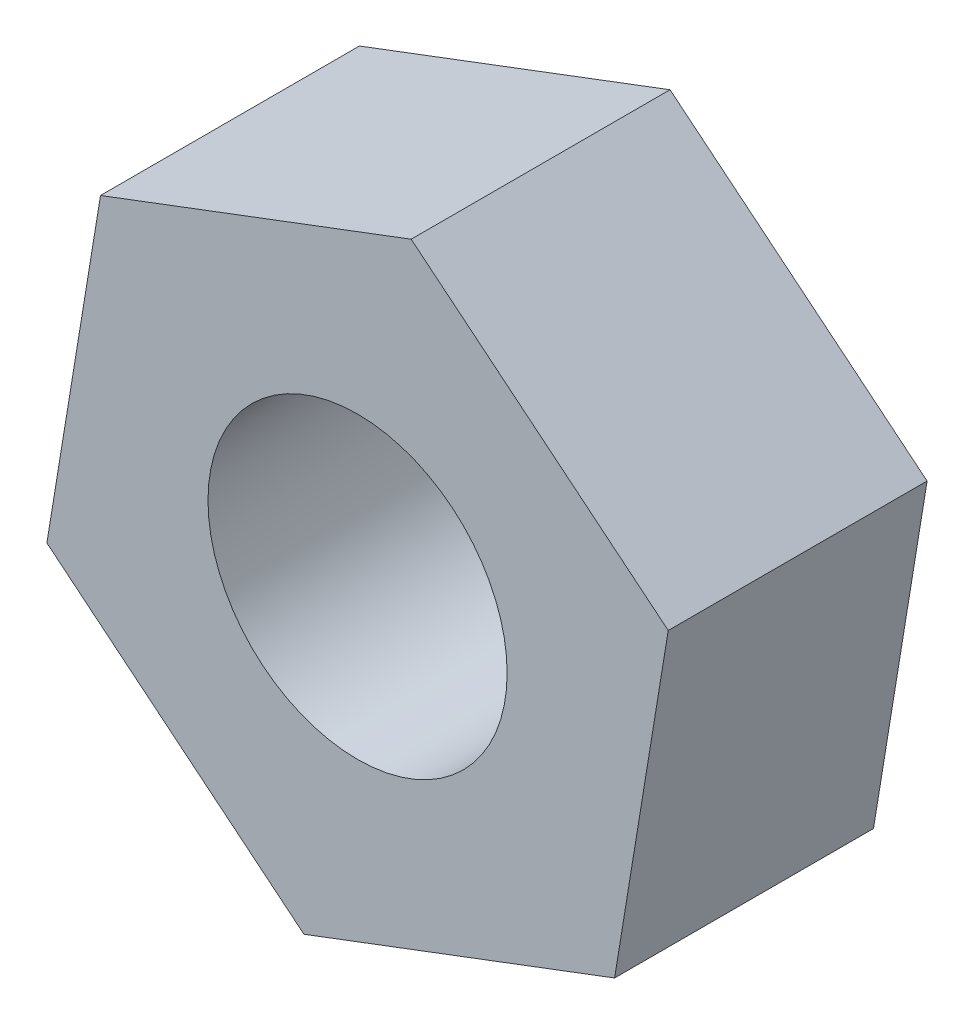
from build123d import *

# Parameters (mm, degrees)
EXTRUDE_1_DEPTH           = 4.5
HOLE_WIZARD_G1_16_1_D     = 5.2
HOLE_WIZARD_G1_16_1_DEPTH = 18.17


with BuildPart() as part:
    # Sketch 2 → Extrude 1 (new body)
    with BuildSketch(Plane.XY):
        Polygon((4.46844455, -3.656000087), (5.400411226, 2.041786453), (0.931966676, 5.697786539), (-4.46844455, 3.656000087), (-5.400411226, -2.041786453), (-0.931966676, -5.697786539), align=None)
    extrude(amount=EXTRUDE_1_DEPTH)

    # Hole Wizard G1_16 _1
    with Locations(Plane(origin=(0, 0, 0), x_dir=(-1, 0, 0), z_dir=(0, 0, -1))):
        with Locations((0, 0)):
            Hole(HOLE_WIZARD_G1_16_1_D / 2, depth=HOLE_WIZARD_G1_16_1_DEPTH)


solid = part.part
